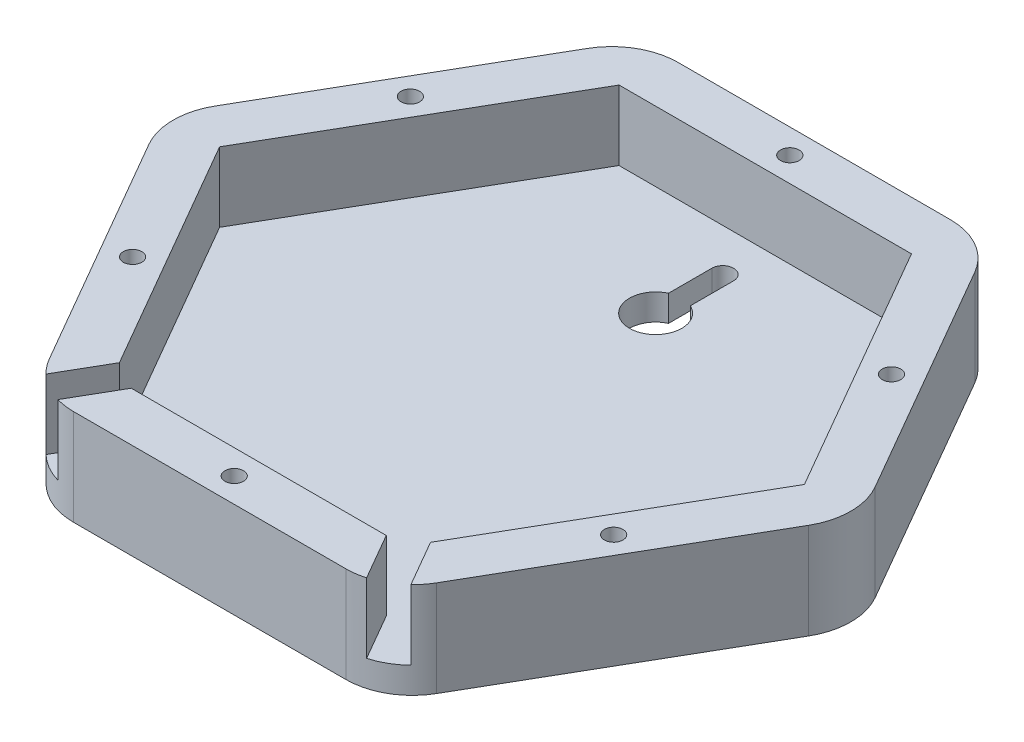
from build123d import *

# Parameters (mm, degrees)
BOSS_EXTRUDE1_DEPTH = 6
BOSS_EXTRUDE2_DEPTH = 16
SKETCH3_R           = 2.125
CUT_EXTRUDE1_DEPTH  = 109.203819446
FILLET1_R           = 15.24
SKETCH21_W          = 16.200980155
SKETCH21_H          = 5.400326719
CUT_EXTRUDE2_DEPTH  = 2
CUT_EXTRUDE3_DEPTH  = 16


with BuildPart() as part:
    # Sketch1 → Boss-Extrude1 (new body)
    with BuildSketch(Plane(origin=(0, 0, 0), x_dir=(1, 0, 0), z_dir=(0, 1, 0))):
        Polygon((-40.042952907, 69.35642892), (40.042952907, 69.35642892), (80.085905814, 0), (40.042952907, -69.35642892), (-40.042952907, -69.35642892), (-80.085905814, 0), align=None)
        with BuildLine():
            Line((-2.5, 48.338928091), (-2.5, 38.402071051))
            ThreePointArc((-2.5, 38.402071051), (0, 26.947714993), (2.5, 38.402071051))
            Line((2.5, 38.402071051), (2.5, 48.338928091))
            ThreePointArc((2.5, 48.338928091), (0, 50.838928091), (-2.5, 48.338928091))
        make_face(mode=Mode.SUBTRACT)
    extrude(amount=BOSS_EXTRUDE1_DEPTH)

    # Sketch2 → Boss-Extrude2 (add)
    with BuildSketch(Plane(origin=(0, 6, 0), x_dir=(1, 0, 0), z_dir=(0, 1, 0))):
        Polygon((80.085905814, 0), (40.042952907, 69.35642892), (-40.042952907, 69.35642892), (-80.085905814, 0), (-40.042952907, -69.35642892), (40.042952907, -69.35642892), align=None)
        Polygon((67.085905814, 0), (33.542952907, 58.098098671), (-33.542952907, 58.098098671), (-67.085905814, 0), (-33.542952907, -58.098098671), (33.542952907, -58.098098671), align=None, mode=Mode.SUBTRACT)
    extrude(amount=BOSS_EXTRUDE2_DEPTH)

    # Sketch3 → Cut-Extrude1 (cut, through all)
    with BuildSketch(Plane(origin=(0, 22, 0), x_dir=(1, 0, 0), z_dir=(0, 1, 0))):
        with Locations(Location((0, 63.727263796, 0), (0, 0, 270))):
            Circle(SKETCH3_R)
        with Locations(Location((55.189429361, 31.863631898, 0), (0, 0, 270))):
            Circle(SKETCH3_R)
        with Locations(Location((55.189429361, -31.863631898, 0), (0, 0, 270))):
            Circle(SKETCH3_R)
        with Locations(Location((0, -63.727263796, 0), (0, 0, 270))):
            Circle(SKETCH3_R)
        with Locations(Location((-55.189429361, -31.863631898, 0), (0, 0, 270))):
            Circle(SKETCH3_R)
        with Locations(Location((-55.189429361, 31.863631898, 0), (0, 0, 270))):
            Circle(SKETCH3_R)
    extrude(amount=-CUT_EXTRUDE1_DEPTH, mode=Mode.SUBTRACT)

    # Fillet1
    fillet1_edges = [part.edges().sort_by_distance(p)[0] for p in [
        (40.042952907, 11, 69.35642892),
        (-40.042952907, 11, 69.35642892),
        (-80.085905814, 11, 0),
        (-40.042952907, 11, -69.35642892),
        (40.042952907, 11, -69.35642892),
        (80.085905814, 11, 0),
    ]]
    fillet(fillet1_edges, radius=FILLET1_R)

    # Sketch21 → Cut-Extrude2 (cut)
    # profile 1 of 15: a face of its own
    with BuildSketch(Plane.XZ):
        with BuildLine():
            Line((-11.702919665, 10.055539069), (-24.359244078, 10.055539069))
            add(Edge.make_bspline(
                [(-24.359244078, 10.055539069), (-27.360887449, 9.575428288), (-30.558004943, 14.129623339), (-29.773274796, 19.547893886), (-26.93652569, 20.646846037)],
                knots=[0, 0, 0, 0, 0.496597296, 1, 1, 1, 1], degree=3))
            add(Edge.make_bspline(
                [(-24.359244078, 32.447137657), (-27.6945628, 33.114049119), (-30.676343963, 29.392617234), (-30.688768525, 23.585062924), (-28.792642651, 20.911576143), (-26.93652569, 20.646846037)],
                knots=[0, 0, 0, 0, 0.489367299, 0.697723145, 1, 1, 1, 1], degree=3))
            Line((-24.359244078, 32.447137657), (-11.702919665, 32.447137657))
            Line((-11.702919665, 32.447137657), (-11.702919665, 10.055539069))
        make_face()
        with BuildLine():
            Line((-17.246618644, 19.00460826), (-22.369365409, 19.00460826))
            add(Edge.make_bspline(
                [(-22.369365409, 15.587581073), (-24.278784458, 17.169216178), (-22.369365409, 19.00460826)],
                knots=[0, 0, 0, 1, 1, 1], degree=2))
            Line((-22.369365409, 15.587581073), (-17.246618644, 15.587581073))
            Line((-17.246618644, 15.587581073), (-17.246618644, 19.00460826))
        make_face(mode=Mode.SUBTRACT)
        with BuildLine():
            Line((-17.246618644, 26.915095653), (-17.246618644, 23.490498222))
            Line((-17.246618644, 23.490498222), (-22.79765419, 23.490498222))
            add(Edge.make_bspline(
                [(-22.79765419, 26.915095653), (-25.632179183, 25.271107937), (-22.79765419, 23.490498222)],
                knots=[0, 0, 0, 1, 1, 1], degree=2))
            Line((-22.79765419, 26.915095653), (-17.246618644, 26.915095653))
        make_face(mode=Mode.SUBTRACT)
    # profile 2 of 15: a face of its own
    with BuildSketch(Plane.XZ):
        with BuildLine():
            Line((-11.702919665, -15.628941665), (-25.939827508, -15.628941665))
            add(Edge.make_bspline(
                [(-25.939827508, -15.628941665), (-25.983817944, -15.585122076), (-26.012855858, -15.51700321), (-26.071798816, -15.497482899), (-26.77145192, -15.265776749), (-27.454632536, -15.204438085), (-28.049061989, -14.711036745), (-28.360530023, -14.452505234), (-28.610091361, -14.122931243), (-28.841146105, -13.790569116), (-29.213710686, -13.254651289), (-29.451983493, -12.598514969), (-29.503309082, -11.94783996), (-29.55843072, -11.249040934), (-30.133539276, -7.565579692), (-28.987212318, -6.414783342), (-28.63665561, -6.062859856), (-28.316520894, -5.677753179), (-27.935542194, -5.359012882), (-27.784947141, -5.233019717), (-27.584643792, -5.182709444), (-27.40919459, -5.094557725)],
                knots=[0, 0, 0, 0, 1, 1, 1, 2, 2, 2, 3, 3, 3, 4, 4, 4, 5, 5, 5, 6, 6, 6, 7, 7, 7, 7], degree=3))
            add(Edge.make_bspline(
                [(-27.40919459, -5.094557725), (-28.749038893, -4.499290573), (-29.605982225, -4.185108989), (-30.195361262, -2.747389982), (-30.43380263, -2.165741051), (-30.600871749, -1.535420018), (-30.606240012, -0.906817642), (-30.625991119, 1.405959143), (-30.873303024, 3.566713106), (-29.077455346, 5.165362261), (-28.258527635, 5.89436512), (-26.714551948, 6.45705591), (-25.66423086, 6.511712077), (-23.909852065, 6.603005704), (-22.153624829, 6.673412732), (-20.396936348, 6.688414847), (-17.49897314, 6.713163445), (-14.600925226, 6.650099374), (-11.702919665, 6.630941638)],
                knots=[0, 0, 0, 0, 1, 1, 1, 2, 2, 2, 3, 3, 3, 4, 4, 4, 5, 5, 5, 6, 6, 6, 6], degree=3))
            Line((-11.702919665, 6.630941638), (-11.702919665, -15.628941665))
        make_face()
        with BuildLine():
            Line((-17.246618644, -10.228614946), (-22.602923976, -10.228614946))
            add(Edge.make_bspline(
                [(-22.602923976, -10.228614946), (-22.748251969, -9.972442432), (-22.995670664, -9.751430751), (-23.038907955, -9.460097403), (-23.135804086, -8.807210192), (-23.02018516, -8.140153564), (-23.010823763, -7.480181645)],
                knots=[0, 0, 0, 0, 1, 1, 1, 2, 2, 2, 2], degree=3))
            add(Edge.make_bspline(
                [(-23.010823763, -7.480181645), (-22.756945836, -7.330881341), (-22.54182316, -7.065603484), (-22.249189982, -7.032280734), (-20.590935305, -6.843451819), (-18.914142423, -6.89329331), (-17.246618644, -6.823799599)],
                knots=[0, 0, 0, 0, 1, 1, 1, 2, 2, 2, 2], degree=3))
            Line((-17.246618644, -6.823799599), (-17.246618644, -10.228614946))
        make_face(mode=Mode.SUBTRACT)
        with BuildLine():
            Line((-17.246618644, -2.193982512), (-23.700667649, -2.062267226))
            add(Edge.make_bspline(
                [(-23.700667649, -2.062267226), (-23.78847784, -1.886646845), (-23.907677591, -1.723474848), (-23.964098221, -1.535406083), (-24.040838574, -1.279604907), (-24.095813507, -1.012178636), (-24.095813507, -0.745114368), (-24.095813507, -0.303873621), (-24.122494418, 0.160208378), (-23.964098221, 0.57203849), (-23.885293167, 0.776931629), (-23.65609045, 0.950019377), (-23.437237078, 0.967184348), (-21.379549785, 1.128571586), (-19.310158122, 1.054994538), (-17.246618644, 1.098899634)],
                knots=[0, 0, 0, 0, 1, 1, 1, 2, 2, 2, 3, 3, 3, 4, 4, 4, 5, 5, 5, 5], degree=3))
            Line((-17.246618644, 1.098899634), (-17.246618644, -2.193982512))
        make_face(mode=Mode.SUBTRACT)
    # profile 3 of 15: a face of its own
    with BuildSketch(Plane.XZ):
        Polygon((5.408410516, 10.055539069), (-2.362791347, 10.055539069), (-9.21198621, 32.447137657), (-3.021367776, 32.447137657), (-1.564958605, 27.046810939), (4.618118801, 27.046810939), (6.066986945, 32.447137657), (12.257605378, 32.447137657), align=None)
        Polygon((1.515763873, 15.719296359), (-0.145486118, 21.65953579), (3.169250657, 21.65953579), align=None, mode=Mode.SUBTRACT)
    # profile 4 of 15: a face of its own
    with BuildSketch(Plane.XZ):
        Polygon((5.540125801, -15.760656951), (-2.362791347, -15.628941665), (-9.21198621, 6.630941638), (-3.021367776, 6.630941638), (-1.564958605, 1.234309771), (4.618118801, 1.234309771), (6.066986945, 6.630941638), (12.257605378, 6.630941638), align=None)
        Polygon((1.588667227, -10.096899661), (-0.145486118, -4.191811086), (3.138445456, -4.191811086), align=None, mode=Mode.SUBTRACT)
    # profile 5 of 15: a face of its own
    with BuildSketch(Plane.XZ):
        with Locations((21.938678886, -12.928778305)):
            Rectangle(SKETCH21_W, SKETCH21_H)
    # profile 6 of 15: a face of its own
    with BuildSketch(Plane.XZ):
        Polygon((30.039168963, -7.726024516), (13.838188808, -7.726024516), (13.838188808, -2.193982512), (23.585119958, -2.193982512), (23.585119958, 6.630941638), (30.039168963, 6.630941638), align=None)
    # profile 7 of 15: a face of its own
    with BuildSketch(Plane.XZ):
        Polygon((30.039168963, 10.055539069), (23.585119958, 10.055539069), (23.585119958, 26.915095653), (13.838188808, 26.915095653), (13.838188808, 32.447137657), (30.039168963, 32.447137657), align=None)
    # profile 8 of 15: a face of its own
    with BuildSketch(Plane.XZ):
        with BuildLine():
            Line((29.901483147, 34.818012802), (27.93172439, 34.818012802))
            Line((27.93172439, 34.818012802), (27.93172439, 37.886038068))
            add(Edge.make_bspline(
                [(27.93172439, 37.886038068), (27.240149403, 37.107580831), (26.725970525, 36.227746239), (26.099316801, 35.402726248), (25.986646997, 35.254390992), (25.912242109, 35.013525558), (25.728172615, 34.984955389), (24.946027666, 34.863555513), (24.145161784, 34.979359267), (23.353656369, 34.976561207)],
                knots=[0, 0, 0, 0, 1, 1, 1, 2, 2, 2, 3, 3, 3, 3], degree=3))
            Line((23.353656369, 34.976561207), (25.955995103, 38.110894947))
            Line((25.955995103, 38.110894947), (23.058258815, 41.930638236))
            add(Edge.make_bspline(
                [(23.058258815, 41.930638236), (23.10216391, 41.974543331), (23.127882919, 42.062353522), (23.189974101, 42.062353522), (24.069172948, 42.062353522), (24.946177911, 41.974543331), (25.824279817, 41.930638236)],
                knots=[0, 0, 0, 0, 1, 1, 1, 2, 2, 2, 2], degree=3))
            Line((25.824279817, 41.930638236), (27.655774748, 39.412908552))
            add(Edge.make_bspline(
                [(27.655774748, 39.412908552), (27.739535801, 39.50458922), (27.894193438, 39.56443633), (27.907057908, 39.687950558), (27.989053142, 40.475202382), (27.923502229, 41.270885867), (27.93172439, 42.062353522)],
                knots=[0, 0, 0, 0, 1, 1, 1, 2, 2, 2, 2], degree=3))
            Line((27.93172439, 42.062353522), (29.901483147, 42.062353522))
            Line((29.901483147, 42.062353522), (29.901483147, 34.818012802))
        make_face()
    # profile 9 of 15: a face of its own
    with BuildSketch(Plane.XZ):
        Polygon((22.279598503, 34.818012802), (20.292237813, 34.818012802), (20.292237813, 37.446149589), (17.657932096, 37.446149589), (17.657932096, 34.818012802), (15.682202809, 34.818012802), (15.682202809, 42.062353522), (17.657932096, 42.062353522), (17.657932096, 38.901186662), (20.292237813, 38.901186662), (20.292237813, 42.062353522), (22.279598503, 42.062353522), align=None)
    # profile 10 of 15: a face of its own
    with BuildSketch(Plane.XZ):
        Polygon((6.462132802, 34.818012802), (2.11552837, 34.818012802), (2.11552837, 36.13516566), (3.311263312, 36.13516566), (3.311263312, 40.745200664), (2.11552837, 40.745200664), (2.11552837, 42.062353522), (6.462132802, 42.062353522), (6.462132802, 40.745200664), (5.258985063, 40.745200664), (5.258985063, 36.13516566), (6.462132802, 36.13516566), align=None)
    # profile 11 of 15: a face of its own
    with BuildSketch(Plane.XZ):
        Polygon((12.12939513, 34.818012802), (9.755014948, 34.818012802), (7.120709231, 42.062353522), (9.232180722, 42.062353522), (9.675143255, 40.613485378), (12.257605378, 40.613485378), (12.668133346, 42.062353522), (14.823086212, 42.062353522), align=None)
        Polygon((10.958709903, 37.057172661), (10.16599363, 39.174451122), (11.746292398, 39.174451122), align=None, mode=Mode.SUBTRACT)
    # profile 12 of 15: a face of its own
    with BuildSketch(Plane.XZ):
        with BuildLine():
            Line((-3.888835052, 38.901186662), (-6.314249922, 42.062353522))
            Line((-6.314249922, 42.062353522), (-3.888835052, 42.062353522))
            Line((-3.888835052, 42.062353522), (-1.926240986, 39.428047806))
            Line((-1.926240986, 39.428047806), (-1.177353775, 39.428047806))
            Line((-1.177353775, 39.428047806), (-1.177353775, 42.062353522))
            Line((-1.177353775, 42.062353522), (0.772518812, 42.062353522))
            Line((0.772518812, 42.062353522), (0.772518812, 34.818012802))
            Line((0.772518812, 34.818012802), (-3.777136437, 34.818012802))
            add(Edge.make_bspline(
                [(-3.888835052, 38.901186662), (-4.872857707, 38.739938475), (-5.878351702, 36.828360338), (-4.717617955, 35.047871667), (-3.777136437, 34.818012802)],
                knots=[0, 0, 0, 0, 0.493152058, 1, 1, 1, 1], degree=3))
        make_face()
        with BuildLine():
            Line((-1.177353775, 37.979179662), (-1.177353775, 36.266880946))
            Line((-1.177353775, 36.266880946), (-2.72698299, 36.266880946))
            add(Edge.make_bspline(
                [(-2.72698299, 37.979179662), (-3.850345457, 37.123030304), (-2.72698299, 36.266880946)],
                knots=[0, 0, 0, 1, 1, 1], degree=2))
            Line((-2.72698299, 37.979179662), (-1.177353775, 37.979179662))
        make_face(mode=Mode.SUBTRACT)
    # profile 13 of 15: a face of its own
    with BuildSketch(Plane.XZ):
        with BuildLine():
            Line((-6.991455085, 34.818012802), (-11.292039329, 34.818012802))
            add(Edge.make_bspline(
                [(-11.292039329, 34.818012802), (-12.313029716, 35.023762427), (-13.748434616, 36.711560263), (-12.360348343, 39.383792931), (-11.322834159, 39.689295), (-10.145216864, 39.832515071)],
                knots=[0, 0, 0, 0, 0.4151055, 0.684406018, 1, 1, 1, 1], degree=3))
            Line((-10.145216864, 39.832515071), (-8.94607718, 39.832515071))
            Line((-8.94607718, 39.832515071), (-8.94607718, 42.062353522))
            Line((-8.94607718, 42.062353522), (-6.991455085, 42.062353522))
            Line((-6.991455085, 42.062353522), (-6.991455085, 34.818012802))
        make_face()
        with BuildLine():
            Line((-8.94607718, 38.241671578), (-8.948555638, 36.266880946))
            Line((-8.948555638, 36.266880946), (-10.365759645, 36.266880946))
            add(Edge.make_bspline(
                [(-10.365759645, 36.266880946), (-11.818321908, 37.254276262), (-10.365759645, 38.241671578)],
                knots=[0, 0, 0, 1, 1, 1], degree=2))
            Line((-10.365759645, 38.241671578), (-8.94607718, 38.241671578))
        make_face(mode=Mode.SUBTRACT)
    # profile 14 of 15: a face of its own
    with BuildSketch(Plane.XZ):
        with BuildLine():
            Line((-14.200460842, 34.818012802), (-16.185744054, 34.818012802))
            Line((-16.185744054, 34.818012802), (-16.185744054, 39.584317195))
            ThreePointArc((-16.185744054, 39.584317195), (-17.504531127, 40.903104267), (-18.823318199, 39.584317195))
            Line((-18.823318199, 39.584317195), (-18.823318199, 34.828882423))
            Line((-18.823318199, 34.828882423), (-20.820953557, 34.828882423))
            Line((-20.820953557, 34.828882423), (-20.820953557, 39.956359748))
            add(Edge.make_bspline(
                [(-20.820953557, 39.956359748), (-20.542171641, 41.576077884), (-17.557789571, 43.095307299), (-14.345052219, 41.583057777), (-14.200460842, 39.956359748)],
                knots=[0, 0, 0, 0, 0.499381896, 1, 1, 1, 1], degree=3))
            Line((-14.200460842, 39.956359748), (-14.200460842, 34.818012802))
        make_face()
    # profile 15 of 15: a face of its own
    with BuildSketch(Plane.XZ):
        with BuildLine():
            Line((-27.122182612, 38.901186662), (-29.554288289, 42.062353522))
            Line((-29.554288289, 42.062353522), (-26.93652569, 42.062353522))
            Line((-26.93652569, 42.062353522), (-25.103813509, 39.428047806))
            Line((-25.103813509, 39.428047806), (-24.359244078, 39.428047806))
            Line((-24.359244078, 39.428047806), (-24.359244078, 42.062353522))
            Line((-24.359244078, 42.062353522), (-22.369365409, 42.062353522))
            Line((-22.369365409, 42.062353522), (-22.369365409, 34.828882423))
            Line((-22.369365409, 34.828882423), (-26.93652569, 34.828882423))
            add(Edge.make_bspline(
                [(-27.122182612, 38.901186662), (-29.88550042, 36.791864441), (-26.93652569, 34.828882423)],
                knots=[0, 0, 0, 1, 1, 1], degree=2))
        make_face()
        with BuildLine():
            Line((-24.359244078, 36.266880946), (-25.692097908, 36.266880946))
            ThreePointArc((-25.692097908, 36.266880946), (-26.548442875, 37.14172824), (-25.655492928, 37.979179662))
            Line((-25.655492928, 37.979179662), (-24.359244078, 37.979179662))
            Line((-24.359244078, 37.979179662), (-24.359244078, 36.266880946))
        make_face(mode=Mode.SUBTRACT)
    extrude(amount=-CUT_EXTRUDE2_DEPTH, mode=Mode.SUBTRACT)

    # Sketch22 → Cut-Extrude3 (cut)
    with BuildSketch(Plane(origin=(0, 22, 0), x_dir=(1, 0, 0), z_dir=(0, 1, 0))):
        Polygon((44.843709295, -70.236539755), (38.404773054, -73.954061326), (13.254389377, -30.392318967), (19.693325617, -26.674797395), align=None)
        Polygon((-38.404773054, -73.954061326), (-44.843709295, -70.236539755), (-19.693325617, -26.674797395), (-13.254389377, -30.392318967), align=None)
    extrude(amount=-CUT_EXTRUDE3_DEPTH, mode=Mode.SUBTRACT)


solid = part.part
